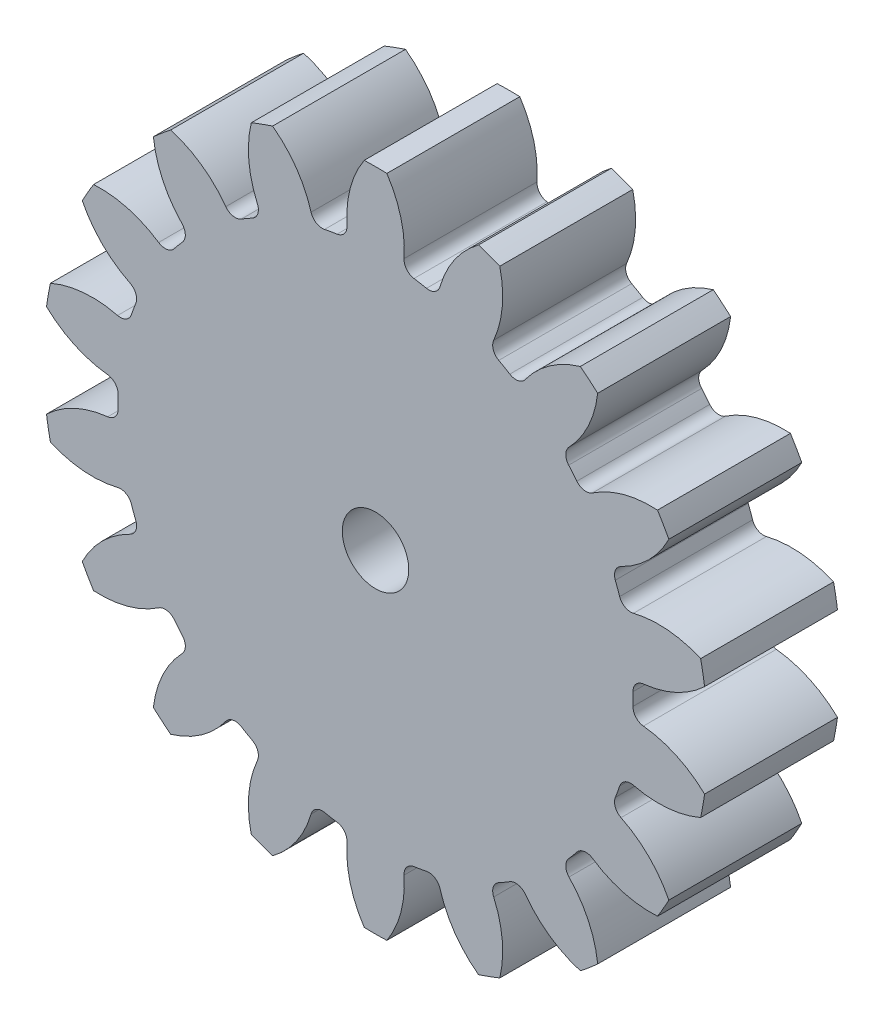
from build123d import *

# Parameters (mm, degrees)
BOSS_EXTRU_1_DEPTH                 = 4
CONG_1_R                           = 0.35
R_P_TITION_CIRCULAIRE4_COUNT       = 18
CONG_1_OF_R_P_TITION_CIRCULAIRE4_R = 0.35
ESQUISSE5_R                        = 5
BOSS_EXTRU_2_DEPTH                 = 1
ENL_V_MAT_EXTRU_1_DEPTH            = 2.6
ESQUISSE7_R                        = 1
ENL_V_MAT_EXTRU_2_DEPTH            = 2.4


with BuildPart() as part:
    # Esquisse3 → Boss.-Extru.1 (new body)
    with BuildSketch(Plane.XY):
        with BuildLine():
            Line((-2.72448029, 7.071907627), (-1.378706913, -0.560352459))
            Line((-1.378706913, -0.560352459), (-0.032933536, 7.071907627))
            ThreePointArc((-0.032933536, 7.071907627), (-0.295200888, 7.113532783), (-0.558740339, 7.146148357))
            ThreePointArc((-0.558740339, 7.146148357), (-0.578939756, 8.335951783), (-1.037941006, 9.433839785))
            ThreePointArc((-1.037941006, 9.433839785), (-1.378706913, 9.439647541), (-1.71947282, 9.433839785))
            ThreePointArc((-1.71947282, 9.433839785), (-2.17847407, 8.335951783), (-2.198673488, 7.146148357))
            ThreePointArc((-2.198673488, 7.146148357), (-2.462212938, 7.113532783), (-2.72448029, 7.071907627))
        make_face()
    boss_extru_1 = extrude(amount=BOSS_EXTRU_1_DEPTH)

    # Cong_1
    cong_1_edges = [part.edges().sort_by_distance(p)[0] for p in [
        (-2.198673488, 7.146148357, 2),
        (-0.558740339, 7.146148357, 2),
    ]]
    fillet(cong_1_edges, radius=CONG_1_R)

    # R_p_tition circulaire4: Boss.-Extru.1 ×18 about axis
    r_p_tition_circulaire4_axis = Axis((-1.378706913, -0.560352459, 0), (0, 0, 1))
    for i in range(1, R_P_TITION_CIRCULAIRE4_COUNT):
        add(boss_extru_1.rotate(r_p_tition_circulaire4_axis, i * 360 / R_P_TITION_CIRCULAIRE4_COUNT))

    # Cong_1 of R_p_tition circulaire4
    cong_1_of_r_p_tition_circulaire4_edges = [part.edges().sort_by_distance(p)[0] for p in [
        (-4.785001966, 6.400944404, 2),
        (-3.243968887, 6.961834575, 2),
        (-6.960480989, 4.816105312, 2),
        (-5.704219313, 5.870234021, 2),
        (-8.462715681, 2.582786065, 2),
        (-7.642749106, 4.003009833, 2),
        (-9.110514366, -0.029642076, 2),
        (-8.825742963, 1.585376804, 2),
        (-8.825742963, -2.706081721, 2),
        (-9.110514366, -1.091062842, 2),
        (-7.642749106, -5.12371475, 2),
        (-8.462715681, -3.703490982, 2),
        (-5.704219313, -6.990938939, 2),
        (-6.960480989, -5.93681023, 2),
        (-3.243968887, -8.082539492, 2),
        (-4.785001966, -7.521649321, 2),
        (-0.558740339, -8.266853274, 2),
        (-2.198673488, -8.266853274, 2),
        (2.02758814, -7.521649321, 2),
        (0.486555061, -8.082539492, 2),
        (4.203067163, -5.93681023, 2),
        (2.946805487, -6.990938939, 2),
        (5.705301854, -3.703490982, 2),
        (4.88533528, -5.12371475, 2),
        (6.35310054, -1.091062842, 2),
        (6.068329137, -2.706081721, 2),
        (6.068329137, 1.585376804, 2),
        (6.35310054, -0.029642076, 2),
        (4.88533528, 4.003009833, 2),
        (5.705301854, 2.582786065, 2),
        (2.946805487, 5.870234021, 2),
        (4.203067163, 4.816105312, 2),
        (0.486555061, 6.961834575, 2),
        (2.02758814, 6.400944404, 2),
    ]]
    fillet(cong_1_of_r_p_tition_circulaire4_edges, radius=CONG_1_OF_R_P_TITION_CIRCULAIRE4_R)

    # Esquisse5 → Boss.-Extru.2 (add)
    with BuildSketch(Plane(origin=(0, 0, 0), x_dir=(-1, 0, 0), z_dir=(0, 0, -1))):
        with Locations(Location((1.378706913, -0.560352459, 0), (0, 0, 180))):
            Circle(ESQUISSE5_R)
    extrude(amount=BOSS_EXTRU_2_DEPTH)

    # Esquisse6 → Enl_v. mat.-Extru.1 (cut)
    with BuildSketch(Plane(origin=(0, 0, -1), x_dir=(-1, 0, 0), z_dir=(0, 0, -1))):
        with BuildLine():
            Line((2.472273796, 1.687782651), (2.220610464, 1.472182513))
            Line((2.220610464, 1.472182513), (2.195109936, 1.802587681))
            ThreePointArc((2.195109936, 1.802587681), (1.866432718, 1.891610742), (1.528706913, 1.935143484))
            Line((1.528706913, 1.935143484), (1.378706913, 1.639647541))
            Line((1.378706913, 1.639647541), (1.228706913, 1.935143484))
            ThreePointArc((1.228706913, 1.935143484), (0.890981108, 1.891610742), (0.56230389, 1.802587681))
            Line((0.56230389, 1.802587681), (0.536803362, 1.472182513))
            Line((0.536803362, 1.472182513), (0.28514003, 1.687782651))
            ThreePointArc((0.28514003, 1.687782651), (-0.010218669, 1.518321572), (-0.279809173, 1.310295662))
            Line((-0.279809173, 1.310295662), (-0.176928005, 0.99528246))
            Line((-0.176928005, 0.99528246), (-0.491941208, 1.098163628))
            ThreePointArc((-0.491941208, 1.098163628), (-0.699967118, 0.828573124), (-0.869428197, 0.533214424))
            Line((-0.869428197, 0.533214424), (-0.653828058, 0.281551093))
            Line((-0.653828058, 0.281551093), (-0.984233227, 0.256050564))
            ThreePointArc((-0.984233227, 0.256050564), (-1.073256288, -0.072626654), (-1.11678903, -0.410352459))
            Line((-1.11678903, -0.410352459), (-0.821293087, -0.560352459))
            Line((-0.821293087, -0.560352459), (-1.11678903, -0.710352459))
            ThreePointArc((-1.11678903, -0.710352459), (-1.073256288, -1.048078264), (-0.984233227, -1.376755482))
            Line((-0.984233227, -1.376755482), (-0.653828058, -1.40225601))
            Line((-0.653828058, -1.40225601), (-0.869428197, -1.653919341))
            ThreePointArc((-0.869428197, -1.653919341), (-0.699967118, -1.949278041), (-0.491941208, -2.218868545))
            Line((-0.491941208, -2.218868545), (-0.176928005, -2.115987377))
            Line((-0.176928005, -2.115987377), (-0.279809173, -2.431000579))
            ThreePointArc((-0.279809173, -2.431000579), (-0.010218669, -2.639026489), (0.28514003, -2.808487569))
            Line((0.28514003, -2.808487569), (0.536803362, -2.59288743))
            Line((0.536803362, -2.59288743), (0.56230389, -2.923292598))
            ThreePointArc((0.56230389, -2.923292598), (0.890981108, -3.01231566), (1.228706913, -3.055848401))
            Line((1.228706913, -3.055848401), (1.378706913, -2.760352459))
            Line((1.378706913, -2.760352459), (1.528706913, -3.055848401))
            ThreePointArc((1.528706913, -3.055848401), (1.866432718, -3.01231566), (2.195109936, -2.923292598))
            Line((2.195109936, -2.923292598), (2.220610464, -2.59288743))
            Line((2.220610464, -2.59288743), (2.472273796, -2.808487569))
            ThreePointArc((2.472273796, -2.808487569), (2.767632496, -2.639026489), (3.037222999, -2.431000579))
            Line((3.037222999, -2.431000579), (2.934341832, -2.115987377))
            Line((2.934341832, -2.115987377), (3.249355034, -2.218868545))
            ThreePointArc((3.249355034, -2.218868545), (3.457380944, -1.949278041), (3.626842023, -1.653919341))
            Line((3.626842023, -1.653919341), (3.411241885, -1.40225601))
            Line((3.411241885, -1.40225601), (3.741647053, -1.376755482))
            ThreePointArc((3.741647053, -1.376755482), (3.830670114, -1.048078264), (3.874202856, -0.710352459))
            Line((3.874202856, -0.710352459), (3.578706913, -0.560352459))
            Line((3.578706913, -0.560352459), (3.874202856, -0.410352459))
            ThreePointArc((3.874202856, -0.410352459), (3.830670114, -0.072626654), (3.741647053, 0.256050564))
            Line((3.741647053, 0.256050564), (3.411241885, 0.281551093))
            Line((3.411241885, 0.281551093), (3.626842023, 0.533214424))
            ThreePointArc((3.626842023, 0.533214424), (3.457380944, 0.828573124), (3.249355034, 1.098163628))
            Line((3.249355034, 1.098163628), (2.934341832, 0.99528246))
            Line((2.934341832, 0.99528246), (3.037222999, 1.310295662))
            ThreePointArc((3.037222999, 1.310295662), (2.767632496, 1.518321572), (2.472273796, 1.687782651))
        make_face()
    extrude(amount=-ENL_V_MAT_EXTRU_1_DEPTH, mode=Mode.SUBTRACT)

    # Esquisse7 → Enl_v. mat.-Extru.2 (cut)
    with BuildSketch(Plane(origin=(0, 0, 1.6), x_dir=(-1, 0, 0), z_dir=(0, 0, -1))):
        with Locations((1.378706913, -0.560352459)):
            Circle(ESQUISSE7_R)
    extrude(amount=-ENL_V_MAT_EXTRU_2_DEPTH, mode=Mode.SUBTRACT)


solid = part.part
